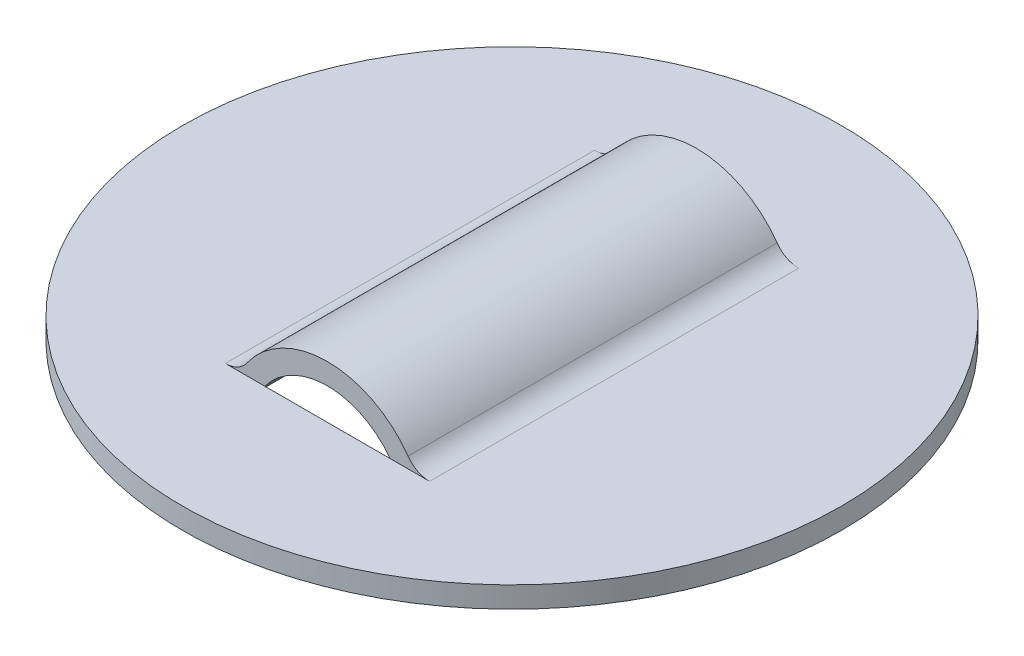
ISO-10303-21;
HEADER;
FILE_DESCRIPTION(('STEP AP214'),'2;1');
FILE_NAME('part.step','',(''),(''),'','','');
FILE_SCHEMA(('AUTOMOTIVE_DESIGN { 1 0 10303 214 1 1 1 1 }'));
ENDSEC;
DATA;
#1=APPLICATION_CONTEXT('core data for automotive mechanical design processes');
#2=APPLICATION_PROTOCOL_DEFINITION('international standard','automotive_design',2000,#1);
#3=PRODUCT_CONTEXT('',#1,'mechanical');
#4=PRODUCT('Part','Part','',(#3));
#5=PRODUCT_RELATED_PRODUCT_CATEGORY('part','',(#4));
#6=PRODUCT_DEFINITION_FORMATION('','',#4);
#7=PRODUCT_DEFINITION_CONTEXT('part definition',#1,'design');
#8=PRODUCT_DEFINITION('design','',#6,#7);
#9=PRODUCT_DEFINITION_SHAPE('','',#8);
#10=(LENGTH_UNIT() NAMED_UNIT(*) SI_UNIT(.MILLI.,.METRE.));
#11=(NAMED_UNIT(*) PLANE_ANGLE_UNIT() SI_UNIT($,.RADIAN.));
#12=(NAMED_UNIT(*) SI_UNIT($,.STERADIAN.) SOLID_ANGLE_UNIT());
#13=UNCERTAINTY_MEASURE_WITH_UNIT(LENGTH_MEASURE(1.E-05),#10,'distance_accuracy_value','');
#14=(GEOMETRIC_REPRESENTATION_CONTEXT(3) GLOBAL_UNCERTAINTY_ASSIGNED_CONTEXT((#13)) GLOBAL_UNIT_ASSIGNED_CONTEXT((#10,
#11,#12)) REPRESENTATION_CONTEXT('',''));
#15=CARTESIAN_POINT('',(0.,0.,0.));
#16=DIRECTION('',(0.,0.,1.));
#17=DIRECTION('',(1.,0.,0.));
#18=AXIS2_PLACEMENT_3D('',#15,#16,#17);
#19=CARTESIAN_POINT('',(0.,-2.2225,17.78));
#20=DIRECTION('',(0.,0.,-1.));
#21=DIRECTION('',(-1.,0.,0.));
#22=AXIS2_PLACEMENT_3D('',#19,#20,#21);
#23=CYLINDRICAL_SURFACE('',#22,4.7625);
#24=CARTESIAN_POINT('',(0.,-2.2225,0.));
#25=DIRECTION('',(0.,0.,-1.));
#26=DIRECTION('',(-1.,0.,0.));
#27=AXIS2_PLACEMENT_3D('',#24,#25,#26);
#28=CIRCLE('',#27,4.7625);
#29=CARTESIAN_POINT('',(-3.88317540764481,0.534736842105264,0.));
#30=VERTEX_POINT('',#29);
#31=CARTESIAN_POINT('',(3.8831754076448,0.534736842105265,0.));
#32=VERTEX_POINT('',#31);
#33=EDGE_CURVE('E164',#30,#32,#28,.T.);
#34=ORIENTED_EDGE('',*,*,#33,.F.);
#35=DIRECTION('',(0.,0.,-1.));
#36=VECTOR('',#35,1.);
#37=CARTESIAN_POINT('',(-3.88317540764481,0.534736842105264,17.78));
#38=LINE('',#37,#36);
#39=CARTESIAN_POINT('',(-3.88317540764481,0.534736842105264,17.78));
#40=VERTEX_POINT('',#39);
#41=EDGE_CURVE('E100',#30,#40,#38,.F.);
#42=ORIENTED_EDGE('',*,*,#41,.T.);
#43=CARTESIAN_POINT('',(0.,-2.2225,17.78));
#44=DIRECTION('',(0.,0.,-1.));
#45=DIRECTION('',(-1.,0.,0.));
#46=AXIS2_PLACEMENT_3D('',#43,#44,#45);
#47=CIRCLE('',#46,4.7625);
#48=CARTESIAN_POINT('',(3.8831754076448,0.534736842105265,17.78));
#49=VERTEX_POINT('',#48);
#50=EDGE_CURVE('E97',#40,#49,#47,.T.);
#51=ORIENTED_EDGE('',*,*,#50,.T.);
#52=DIRECTION('',(0.,0.,-1.));
#53=VECTOR('',#52,1.);
#54=CARTESIAN_POINT('',(3.8831754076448,0.534736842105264,17.78));
#55=LINE('',#54,#53);
#56=EDGE_CURVE('E127',#49,#32,#55,.T.);
#57=ORIENTED_EDGE('',*,*,#56,.T.);
#58=EDGE_LOOP('',(#34,#42,#51,#57));
#59=FACE_BOUND('',#58,.T.);
#60=ADVANCED_FACE('F18',(#59),#23,.T.);
#61=CARTESIAN_POINT('',(-4.91868884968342,1.27,17.78));
#62=DIRECTION('',(0.,0.,-1.));
#63=DIRECTION('',(-1.,0.,0.));
#64=AXIS2_PLACEMENT_3D('',#61,#62,#63);
#65=CYLINDRICAL_SURFACE('',#64,1.27);
#66=CARTESIAN_POINT('',(-4.91868884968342,1.27,17.78));
#67=DIRECTION('',(0.,0.,-1.));
#68=DIRECTION('',(-1.,0.,0.));
#69=AXIS2_PLACEMENT_3D('',#66,#67,#68);
#70=CIRCLE('',#69,1.27);
#71=CARTESIAN_POINT('',(-4.91868884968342,0.,17.78));
#72=VERTEX_POINT('',#71);
#73=EDGE_CURVE('E21',#72,#40,#70,.F.);
#74=ORIENTED_EDGE('',*,*,#73,.T.);
#75=ORIENTED_EDGE('',*,*,#41,.F.);
#76=CARTESIAN_POINT('',(-4.91868884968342,1.27,0.));
#77=DIRECTION('',(0.,0.,-1.));
#78=DIRECTION('',(-1.,0.,0.));
#79=AXIS2_PLACEMENT_3D('',#76,#77,#78);
#80=CIRCLE('',#79,1.27);
#81=CARTESIAN_POINT('',(-4.91868884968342,0.,0.));
#82=VERTEX_POINT('',#81);
#83=EDGE_CURVE('E116',#82,#30,#80,.F.);
#84=ORIENTED_EDGE('',*,*,#83,.F.);
#85=DIRECTION('',(0.,0.,1.));
#86=VECTOR('',#85,1.);
#87=CARTESIAN_POINT('',(-4.91868884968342,0.,17.78));
#88=LINE('',#87,#86);
#89=EDGE_CURVE('E108',#82,#72,#88,.T.);
#90=ORIENTED_EDGE('',*,*,#89,.T.);
#91=EDGE_LOOP('',(#74,#75,#84,#90));
#92=FACE_BOUND('',#91,.T.);
#93=ADVANCED_FACE('F114',(#92),#65,.F.);
#94=CARTESIAN_POINT('',(-4.91868884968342,1.27,17.78));
#95=DIRECTION('',(0.,0.,-1.));
#96=DIRECTION('',(-1.,0.,0.));
#97=AXIS2_PLACEMENT_3D('',#94,#95,#96);
#98=PLANE('',#97);
#99=CARTESIAN_POINT('',(4.91868884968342,1.27,17.78));
#100=DIRECTION('',(0.,0.,-1.));
#101=DIRECTION('',(-1.,0.,0.));
#102=AXIS2_PLACEMENT_3D('',#99,#100,#101);
#103=CIRCLE('',#102,1.27);
#104=CARTESIAN_POINT('',(4.91868884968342,0.,17.78));
#105=VERTEX_POINT('',#104);
#106=EDGE_CURVE('E130',#105,#49,#103,.T.);
#107=ORIENTED_EDGE('',*,*,#106,.T.);
#108=ORIENTED_EDGE('',*,*,#50,.F.);
#109=ORIENTED_EDGE('',*,*,#73,.F.);
#110=DIRECTION('',(1.,0.,0.));
#111=VECTOR('',#110,1.);
#112=CARTESIAN_POINT('',(4.91868884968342,0.,17.78));
#113=LINE('',#112,#111);
#114=CARTESIAN_POINT('',(-3.01608289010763,0.,17.78));
#115=VERTEX_POINT('',#114);
#116=EDGE_CURVE('E95',#72,#115,#113,.T.);
#117=ORIENTED_EDGE('',*,*,#116,.T.);
#118=CARTESIAN_POINT('',(0.,-2.2225,17.78));
#119=DIRECTION('',(0.,0.,-1.));
#120=DIRECTION('',(-1.,0.,0.));
#121=AXIS2_PLACEMENT_3D('',#118,#119,#120);
#122=CIRCLE('',#121,3.7465);
#123=CARTESIAN_POINT('',(3.01608289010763,0.,17.78));
#124=VERTEX_POINT('',#123);
#125=EDGE_CURVE('E119',#115,#124,#122,.T.);
#126=ORIENTED_EDGE('',*,*,#125,.T.);
#127=DIRECTION('',(1.,0.,0.));
#128=VECTOR('',#127,1.);
#129=CARTESIAN_POINT('',(4.91868884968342,0.,17.78));
#130=LINE('',#129,#128);
#131=EDGE_CURVE('E112',#124,#105,#130,.T.);
#132=ORIENTED_EDGE('',*,*,#131,.T.);
#133=EDGE_LOOP('',(#107,#108,#109,#117,#126,#132));
#134=FACE_BOUND('',#133,.T.);
#135=ADVANCED_FACE('F93',(#134),#98,.F.);
#136=CARTESIAN_POINT('',(4.91868884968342,1.27,17.78));
#137=DIRECTION('',(0.,0.,-1.));
#138=DIRECTION('',(-1.,0.,0.));
#139=AXIS2_PLACEMENT_3D('',#136,#137,#138);
#140=CYLINDRICAL_SURFACE('',#139,1.27);
#141=ORIENTED_EDGE('',*,*,#106,.F.);
#142=DIRECTION('',(0.,0.,1.));
#143=VECTOR('',#142,1.);
#144=CARTESIAN_POINT('',(4.91868884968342,0.,17.78));
#145=LINE('',#144,#143);
#146=CARTESIAN_POINT('',(4.91868884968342,0.,0.));
#147=VERTEX_POINT('',#146);
#148=EDGE_CURVE('E178',#105,#147,#145,.F.);
#149=ORIENTED_EDGE('',*,*,#148,.T.);
#150=CARTESIAN_POINT('',(4.91868884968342,1.27,0.));
#151=DIRECTION('',(0.,0.,-1.));
#152=DIRECTION('',(-1.,0.,0.));
#153=AXIS2_PLACEMENT_3D('',#150,#151,#152);
#154=CIRCLE('',#153,1.27);
#155=EDGE_CURVE('E129',#32,#147,#154,.F.);
#156=ORIENTED_EDGE('',*,*,#155,.F.);
#157=ORIENTED_EDGE('',*,*,#56,.F.);
#158=EDGE_LOOP('',(#141,#149,#156,#157));
#159=FACE_BOUND('',#158,.T.);
#160=ADVANCED_FACE('F174',(#159),#140,.F.);
#161=CARTESIAN_POINT('',(-4.91868884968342,1.27,0.));
#162=DIRECTION('',(0.,0.,-1.));
#163=DIRECTION('',(-1.,0.,0.));
#164=AXIS2_PLACEMENT_3D('',#161,#162,#163);
#165=PLANE('',#164);
#166=ORIENTED_EDGE('',*,*,#83,.T.);
#167=ORIENTED_EDGE('',*,*,#33,.T.);
#168=ORIENTED_EDGE('',*,*,#155,.T.);
#169=DIRECTION('',(1.,0.,0.));
#170=VECTOR('',#169,1.);
#171=CARTESIAN_POINT('',(4.91868884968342,0.,0.));
#172=LINE('',#171,#170);
#173=CARTESIAN_POINT('',(3.01608289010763,0.,0.));
#174=VERTEX_POINT('',#173);
#175=EDGE_CURVE('E154',#147,#174,#172,.F.);
#176=ORIENTED_EDGE('',*,*,#175,.T.);
#177=CARTESIAN_POINT('',(0.,-2.2225,0.));
#178=DIRECTION('',(0.,0.,-1.));
#179=DIRECTION('',(-1.,0.,0.));
#180=AXIS2_PLACEMENT_3D('',#177,#178,#179);
#181=CIRCLE('',#180,3.7465);
#182=CARTESIAN_POINT('',(-3.01608289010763,0.,0.));
#183=VERTEX_POINT('',#182);
#184=EDGE_CURVE('E158',#174,#183,#181,.F.);
#185=ORIENTED_EDGE('',*,*,#184,.T.);
#186=DIRECTION('',(1.,0.,0.));
#187=VECTOR('',#186,1.);
#188=CARTESIAN_POINT('',(4.91868884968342,0.,0.));
#189=LINE('',#188,#187);
#190=EDGE_CURVE('E117',#183,#82,#189,.F.);
#191=ORIENTED_EDGE('',*,*,#190,.T.);
#192=EDGE_LOOP('',(#166,#167,#168,#176,#185,#191));
#193=FACE_BOUND('',#192,.T.);
#194=ADVANCED_FACE('F185',(#193),#165,.T.);
#195=CARTESIAN_POINT('',(0.,-2.2225,17.78));
#196=DIRECTION('',(0.,0.,-1.));
#197=DIRECTION('',(-1.,0.,0.));
#198=AXIS2_PLACEMENT_3D('',#195,#196,#197);
#199=CYLINDRICAL_SURFACE('',#198,3.7465);
#200=CARTESIAN_POINT('',(0.,-2.2225,17.78));
#201=DIRECTION('',(0.,0.,-1.));
#202=DIRECTION('',(-1.,0.,0.));
#203=AXIS2_PLACEMENT_3D('',#200,#201,#202);
#204=CIRCLE('',#203,3.7465);
#205=CARTESIAN_POINT('',(-3.05476465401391,-0.0534736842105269,17.78));
#206=VERTEX_POINT('',#205);
#207=EDGE_CURVE('E148',#115,#206,#204,.F.);
#208=ORIENTED_EDGE('',*,*,#207,.T.);
#209=DIRECTION('',(0.,0.,1.));
#210=VECTOR('',#209,1.);
#211=CARTESIAN_POINT('',(-3.05476465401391,-0.0534736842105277,0.));
#212=LINE('',#211,#210);
#213=CARTESIAN_POINT('',(-3.05476465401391,-0.0534736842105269,0.));
#214=VERTEX_POINT('',#213);
#215=EDGE_CURVE('E141',#214,#206,#212,.T.);
#216=ORIENTED_EDGE('',*,*,#215,.F.);
#217=CARTESIAN_POINT('',(0.,-2.2225,0.));
#218=DIRECTION('',(0.,0.,1.));
#219=DIRECTION('',(1.,0.,0.));
#220=AXIS2_PLACEMENT_3D('',#217,#218,#219);
#221=CIRCLE('',#220,3.7465);
#222=EDGE_CURVE('E156',#183,#214,#221,.T.);
#223=ORIENTED_EDGE('',*,*,#222,.F.);
#224=ORIENTED_EDGE('',*,*,#184,.F.);
#225=CARTESIAN_POINT('',(0.,-2.2225,0.));
#226=DIRECTION('',(0.,0.,1.));
#227=DIRECTION('',(1.,0.,0.));
#228=AXIS2_PLACEMENT_3D('',#225,#226,#227);
#229=CIRCLE('',#228,3.7465);
#230=CARTESIAN_POINT('',(3.05476465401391,-0.0534736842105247,0.));
#231=VERTEX_POINT('',#230);
#232=EDGE_CURVE('E161',#231,#174,#229,.T.);
#233=ORIENTED_EDGE('',*,*,#232,.F.);
#234=DIRECTION('',(0.,0.,1.));
#235=VECTOR('',#234,1.);
#236=CARTESIAN_POINT('',(3.05476465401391,-0.0534736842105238,0.));
#237=LINE('',#236,#235);
#238=CARTESIAN_POINT('',(3.05476465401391,-0.0534736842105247,17.78));
#239=VERTEX_POINT('',#238);
#240=EDGE_CURVE('E153',#239,#231,#237,.F.);
#241=ORIENTED_EDGE('',*,*,#240,.F.);
#242=CARTESIAN_POINT('',(0.,-2.2225,17.78));
#243=DIRECTION('',(0.,0.,-1.));
#244=DIRECTION('',(-1.,0.,0.));
#245=AXIS2_PLACEMENT_3D('',#242,#243,#244);
#246=CIRCLE('',#245,3.7465);
#247=EDGE_CURVE('E142',#239,#124,#246,.F.);
#248=ORIENTED_EDGE('',*,*,#247,.T.);
#249=ORIENTED_EDGE('',*,*,#125,.F.);
#250=EDGE_LOOP('',(#208,#216,#223,#224,#233,#241,#248,#249));
#251=FACE_BOUND('',#250,.T.);
#252=ADVANCED_FACE('F192',(#251),#199,.F.);
#253=CARTESIAN_POINT('',(4.91868884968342,0.,17.78));
#254=DIRECTION('',(0.,-1.,0.));
#255=DIRECTION('',(1.,0.,0.));
#256=AXIS2_PLACEMENT_3D('',#253,#254,#255);
#257=PLANE('',#256);
#258=ORIENTED_EDGE('',*,*,#175,.F.);
#259=ORIENTED_EDGE('',*,*,#148,.F.);
#260=ORIENTED_EDGE('',*,*,#131,.F.);
#261=DIRECTION('',(1.,0.,0.));
#262=VECTOR('',#261,1.);
#263=CARTESIAN_POINT('',(4.91868884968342,0.,17.78));
#264=LINE('',#263,#262);
#265=EDGE_CURVE('E111',#124,#115,#264,.F.);
#266=ORIENTED_EDGE('',*,*,#265,.T.);
#267=ORIENTED_EDGE('',*,*,#116,.F.);
#268=ORIENTED_EDGE('',*,*,#89,.F.);
#269=ORIENTED_EDGE('',*,*,#190,.F.);
#270=DIRECTION('',(1.,0.,0.));
#271=VECTOR('',#270,1.);
#272=CARTESIAN_POINT('',(4.91868884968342,0.,0.));
#273=LINE('',#272,#271);
#274=EDGE_CURVE('E122',#174,#183,#273,.F.);
#275=ORIENTED_EDGE('',*,*,#274,.F.);
#276=EDGE_LOOP('',(#258,#259,#260,#266,#267,#268,#269,#275));
#277=FACE_BOUND('',#276,.T.);
#278=CARTESIAN_POINT('',(0.,0.,8.89));
#279=DIRECTION('',(0.,-1.,0.));
#280=DIRECTION('',(1.,0.,0.));
#281=AXIS2_PLACEMENT_3D('',#278,#279,#280);
#282=CIRCLE('',#281,15.875);
#283=CARTESIAN_POINT('',(15.875,0.,8.89));
#284=VERTEX_POINT('',#283);
#285=EDGE_CURVE('E150',#284,#284,#282,.T.);
#286=ORIENTED_EDGE('',*,*,#285,.F.);
#287=EDGE_LOOP('',(#286));
#288=FACE_BOUND('',#287,.T.);
#289=ADVANCED_FACE('F105',(#277,#288),#257,.F.);
#290=CARTESIAN_POINT('',(0.,0.,8.89));
#291=DIRECTION('',(0.,-1.,0.));
#292=DIRECTION('',(1.,0.,0.));
#293=AXIS2_PLACEMENT_3D('',#290,#291,#292);
#294=CYLINDRICAL_SURFACE('',#293,15.875);
#295=CARTESIAN_POINT('',(0.,-1.016,8.89));
#296=DIRECTION('',(0.,-1.,0.));
#297=DIRECTION('',(1.,0.,0.));
#298=AXIS2_PLACEMENT_3D('',#295,#296,#297);
#299=CIRCLE('',#298,15.875);
#300=CARTESIAN_POINT('',(15.875,-1.016,8.89));
#301=VERTEX_POINT('',#300);
#302=EDGE_CURVE('E131',#301,#301,#299,.F.);
#303=ORIENTED_EDGE('',*,*,#302,.T.);
#304=EDGE_LOOP('',(#303));
#305=FACE_BOUND('',#304,.T.);
#306=ORIENTED_EDGE('',*,*,#285,.T.);
#307=EDGE_LOOP('',(#306));
#308=FACE_BOUND('',#307,.T.);
#309=ADVANCED_FACE('F221',(#305,#308),#294,.T.);
#310=CARTESIAN_POINT('',(4.91868884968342,1.27,0.));
#311=DIRECTION('',(0.,0.,1.));
#312=DIRECTION('',(1.,0.,0.));
#313=AXIS2_PLACEMENT_3D('',#310,#311,#312);
#314=CYLINDRICAL_SURFACE('',#313,2.286);
#315=CARTESIAN_POINT('',(4.91868884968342,1.27,0.));
#316=DIRECTION('',(0.,0.,1.));
#317=DIRECTION('',(1.,0.,0.));
#318=AXIS2_PLACEMENT_3D('',#315,#316,#317);
#319=CIRCLE('',#318,2.286);
#320=CARTESIAN_POINT('',(4.91868884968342,-1.016,0.));
#321=VERTEX_POINT('',#320);
#322=EDGE_CURVE('E135',#321,#231,#319,.F.);
#323=ORIENTED_EDGE('',*,*,#322,.F.);
#324=DIRECTION('',(0.,0.,1.));
#325=VECTOR('',#324,1.);
#326=CARTESIAN_POINT('',(4.91868884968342,-1.016,17.78));
#327=LINE('',#326,#325);
#328=CARTESIAN_POINT('',(4.91868884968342,-1.016,17.78));
#329=VERTEX_POINT('',#328);
#330=EDGE_CURVE('E134',#321,#329,#327,.T.);
#331=ORIENTED_EDGE('',*,*,#330,.T.);
#332=CARTESIAN_POINT('',(4.91868884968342,1.27,17.78));
#333=DIRECTION('',(0.,0.,1.));
#334=DIRECTION('',(1.,0.,0.));
#335=AXIS2_PLACEMENT_3D('',#332,#333,#334);
#336=CIRCLE('',#335,2.286);
#337=EDGE_CURVE('E145',#329,#239,#336,.F.);
#338=ORIENTED_EDGE('',*,*,#337,.T.);
#339=ORIENTED_EDGE('',*,*,#240,.T.);
#340=EDGE_LOOP('',(#323,#331,#338,#339));
#341=FACE_BOUND('',#340,.T.);
#342=ADVANCED_FACE('F195',(#341),#314,.T.);
#343=CARTESIAN_POINT('',(4.91868884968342,1.27,17.78));
#344=DIRECTION('',(0.,0.,1.));
#345=DIRECTION('',(1.,0.,0.));
#346=AXIS2_PLACEMENT_3D('',#343,#344,#345);
#347=PLANE('',#346);
#348=ORIENTED_EDGE('',*,*,#337,.F.);
#349=DIRECTION('',(1.,0.,0.));
#350=VECTOR('',#349,1.);
#351=CARTESIAN_POINT('',(-15.875,-1.016,17.78));
#352=LINE('',#351,#350);
#353=CARTESIAN_POINT('',(-4.91868884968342,-1.016,17.78));
#354=VERTEX_POINT('',#353);
#355=EDGE_CURVE('E199',#329,#354,#352,.F.);
#356=ORIENTED_EDGE('',*,*,#355,.T.);
#357=CARTESIAN_POINT('',(-4.91868884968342,1.27,17.78));
#358=DIRECTION('',(0.,0.,1.));
#359=DIRECTION('',(1.,0.,0.));
#360=AXIS2_PLACEMENT_3D('',#357,#358,#359);
#361=CIRCLE('',#360,2.286);
#362=EDGE_CURVE('E139',#206,#354,#361,.F.);
#363=ORIENTED_EDGE('',*,*,#362,.F.);
#364=ORIENTED_EDGE('',*,*,#207,.F.);
#365=ORIENTED_EDGE('',*,*,#265,.F.);
#366=ORIENTED_EDGE('',*,*,#247,.F.);
#367=EDGE_LOOP('',(#348,#356,#363,#364,#365,#366));
#368=FACE_BOUND('',#367,.T.);
#369=ADVANCED_FACE('F210',(#368),#347,.F.);
#370=CARTESIAN_POINT('',(-4.91868884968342,1.27,0.));
#371=DIRECTION('',(0.,0.,1.));
#372=DIRECTION('',(1.,0.,0.));
#373=AXIS2_PLACEMENT_3D('',#370,#371,#372);
#374=CYLINDRICAL_SURFACE('',#373,2.286);
#375=CARTESIAN_POINT('',(-4.91868884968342,1.27,0.));
#376=DIRECTION('',(0.,0.,1.));
#377=DIRECTION('',(1.,0.,0.));
#378=AXIS2_PLACEMENT_3D('',#375,#376,#377);
#379=CIRCLE('',#378,2.286);
#380=CARTESIAN_POINT('',(-4.91868884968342,-1.016,0.));
#381=VERTEX_POINT('',#380);
#382=EDGE_CURVE('E35',#214,#381,#379,.F.);
#383=ORIENTED_EDGE('',*,*,#382,.F.);
#384=ORIENTED_EDGE('',*,*,#215,.T.);
#385=ORIENTED_EDGE('',*,*,#362,.T.);
#386=DIRECTION('',(0.,0.,1.));
#387=VECTOR('',#386,1.);
#388=CARTESIAN_POINT('',(-4.91868884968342,-1.016,17.78));
#389=LINE('',#388,#387);
#390=EDGE_CURVE('E27',#354,#381,#389,.F.);
#391=ORIENTED_EDGE('',*,*,#390,.T.);
#392=EDGE_LOOP('',(#383,#384,#385,#391));
#393=FACE_BOUND('',#392,.T.);
#394=ADVANCED_FACE('F205',(#393),#374,.T.);
#395=CARTESIAN_POINT('',(4.91868884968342,1.27,0.));
#396=DIRECTION('',(0.,0.,1.));
#397=DIRECTION('',(1.,0.,0.));
#398=AXIS2_PLACEMENT_3D('',#395,#396,#397);
#399=PLANE('',#398);
#400=ORIENTED_EDGE('',*,*,#322,.T.);
#401=ORIENTED_EDGE('',*,*,#232,.T.);
#402=ORIENTED_EDGE('',*,*,#274,.T.);
#403=ORIENTED_EDGE('',*,*,#222,.T.);
#404=ORIENTED_EDGE('',*,*,#382,.T.);
#405=DIRECTION('',(1.,0.,0.));
#406=VECTOR('',#405,1.);
#407=CARTESIAN_POINT('',(-15.875,-1.016,0.));
#408=LINE('',#407,#406);
#409=EDGE_CURVE('E11',#381,#321,#408,.T.);
#410=ORIENTED_EDGE('',*,*,#409,.T.);
#411=EDGE_LOOP('',(#400,#401,#402,#403,#404,#410));
#412=FACE_BOUND('',#411,.T.);
#413=ADVANCED_FACE('F188',(#412),#399,.T.);
#414=CARTESIAN_POINT('',(-15.875,-1.016,17.78));
#415=DIRECTION('',(0.,1.,0.));
#416=DIRECTION('',(0.,0.,1.));
#417=AXIS2_PLACEMENT_3D('',#414,#415,#416);
#418=PLANE('',#417);
#419=ORIENTED_EDGE('',*,*,#390,.F.);
#420=ORIENTED_EDGE('',*,*,#355,.F.);
#421=ORIENTED_EDGE('',*,*,#330,.F.);
#422=ORIENTED_EDGE('',*,*,#409,.F.);
#423=EDGE_LOOP('',(#419,#420,#421,#422));
#424=FACE_BOUND('',#423,.T.);
#425=ORIENTED_EDGE('',*,*,#302,.F.);
#426=EDGE_LOOP('',(#425));
#427=FACE_BOUND('',#426,.T.);
#428=ADVANCED_FACE('F215',(#424,#427),#418,.F.);
#429=CLOSED_SHELL('',(#60,#93,#135,#160,#194,#252,#289,#309,#342,#369,#394,#413,#428));
#430=MANIFOLD_SOLID_BREP('B1',#429);
#431=ADVANCED_BREP_SHAPE_REPRESENTATION('',(#18,#430),#14);
#432=SHAPE_DEFINITION_REPRESENTATION(#9,#431);
ENDSEC;
END-ISO-10303-21;
